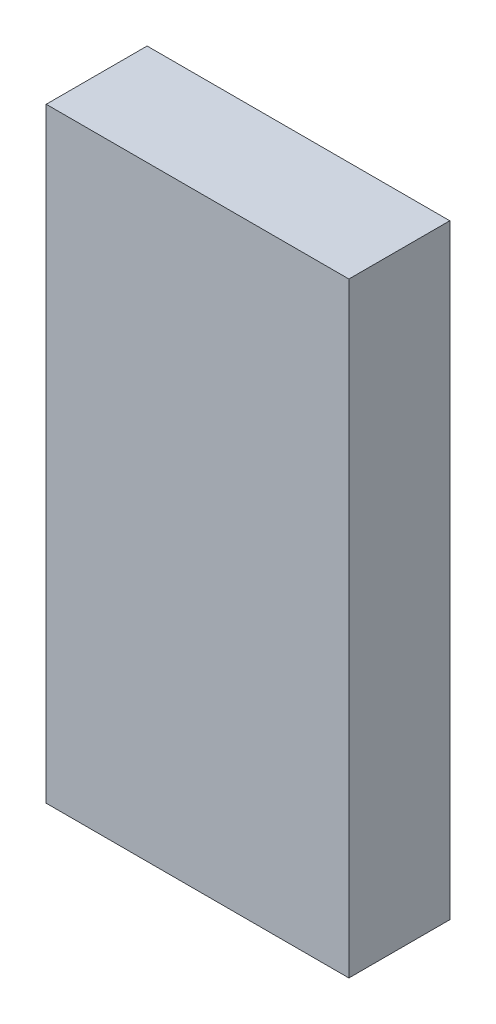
from build123d import *

# Parameters (mm, degrees)
ESQUISSE1_W      = 30
ESQUISSE1_H      = 60
EXTRUSION1_DEPTH = 10


with BuildPart() as part:
    # Esquisse1 → Extrusion1 (new body)
    with BuildSketch(Plane.XY):
        with Locations((15, -30)):
            Rectangle(ESQUISSE1_W, ESQUISSE1_H)
    extrude(amount=EXTRUSION1_DEPTH)


solid = part.part
